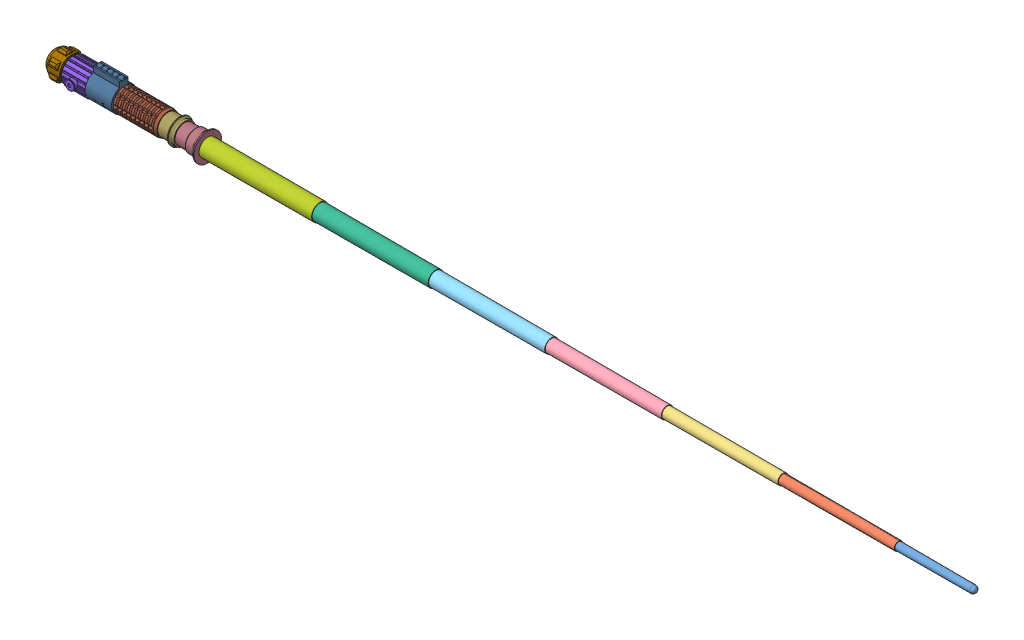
SolidWorks assembly Luke Skywalker's Return of the Jedi Lightsaber.SLDASM, configuration Default (file format 8000). Lengths in mm.
Overall size (1684.61 94.96 54.4).
15 component instances, 15 part files, 31 mates.
Components (placement in the parent):
- Blade 1-1: Blade 1.sldprt [Default] at (1477.9625 0 0) x (1 0 0) z (0 -0.971168 0.238396) size (172.36 13.85 13.85)
- Blade 2-1: Blade 2.sldprt [Default] at (1266.825 0 0) x (1 0 0) z (0 -0.978512 0.206192) size (241.3 16.88 16.88)
- Blade 3-1: Blade 3.sldprt [Default] at (1055.6875 0 0) x (1 0 0) z (0 0.380326 -0.924853) size (241.3 19.91 19.91)
- Blade 4-1: Blade 4.sldprt [Default] at (844.55 0 0) x (1 0 0) z (0 0.994163 -0.107886) size (241.3 22.93 22.93)
- Blade 5-1: Blade 5.sldprt [Default] at (633.4125 0 0) x (1 0 0) z (0 0.970787 0.239945) size (241.3 25.96 25.96)
- Blade 6-1: Blade 6.sldprt [Default] at (422.275 0 0) x (1 0 0) z (0 0.858988 0.511995) size (241.3 28.98 28.98)
- Blade 7-1: Blade 7.sldprt [Default] at (211.1375 0 0) x (1 0 0) z (0 0.854899 0.518794) size (241.3 32.01 32.01)
- Blade 8-1: Blade 8.sldprt [Default] at (227.33 0 0) x (1 0 0) z (0 -0.589235 -0.807962) (suppressed, hidden)
- Blade 9-1: Blade 9.sldprt [Default] at (211.1375 0 0) x (1 0 0) z (0 0.873222 -0.487322) (suppressed, hidden)
- Bottom Grips-5: Bottom Grips.sldprt [Default] at origin size (44.49 47.2 52.39)
- Bottom-2: Bottom.sldprt [Default] at origin size (36.2 50.97 46.82)
- Activator-3: Activator.sldprt [Default] at origin size (48.13 56.94 48.05)
- Top Grips-3: Top Grips.sldprt [Default] at origin size (80.68 42.84 42.84)
- Top 1-3: Top 1.sldprt [Default] at origin size (30.38 45.29 45.29)
- Top 2-3: Top 2.sldprt [Default] at origin size (42.1 50.46 50.46)
Mates (geometry in assembly coordinates):
- Blade Travel Hilt to Nine: limit distance = 211.1375 mm anti-aligned: plane of Blade 9-1 through (249.2375 16.1273 6.9539) normal (-1 0 0); plane of ? through (38.1 0 0) normal (1 0 0)
- Blade Travel Eight to Nine: limit distance = 211.1375 mm aligned: plane of Blade 9-1 through (244.6655 -8.5587 -15.3361) normal (-1 0 0); plane of Blade 8-1 through (455.803 -13.109 9.5602) normal (-1 0 0)
- Blade Travel Seven to Eight: limit distance = 211.1375 mm aligned: plane of Blade 8-1 through (246.38 -14.1432 10.3145) normal (-1 0 0); plane of Blade 7-1 through (424.18 8.3036 -13.6832) normal (-1 0 0)
- Blade Travel Six to Seven: limit distance = 211.1375 mm aligned: plane of Blade 7-1 through (245.4275 8.3036 -13.6832) normal (-1 0 0); plane of Blade 6-1 through (456.565 7.42 -12.4488) normal (-1 0 0)
- Blade Travel Five to Six: limit distance = 211.1375 mm aligned: plane of Blade 6-1 through (456.565 7.42 -12.4488) normal (-1 0 0); plane of Blade 5-1 through (667.7025 3.1143 -12.6001) normal (-1 0 0)
- Blade Travel Four to Five: limit distance = 211.1375 mm aligned: plane of Blade 5-1 through (667.7025 3.1143 -12.6001) normal (-1 0 0); plane of Blade 4-1 through (878.84 -1.237 -11.3991) normal (-1 0 0)
- Blade Travel Three to Four: limit distance = 211.1375 mm aligned: plane of Blade 4-1 through (878.84 -1.237 -11.3991) normal (-1 0 0); plane of Blade 3-1 through (1089.9775 -9.2049 -3.7853) normal (-1 0 0)
- Blade Travel Two to Three: limit distance = 211.1375 mm aligned: plane of Blade 3-1 through (1089.9775 -9.2049 -3.7853) normal (-1 0 0); plane of Blade 2-1 through (1301.115 1.7402 8.2583) normal (-1 0 0)
- Blade Travel One to Two: limit distance = 211.1375 mm aligned: plane of Blade 2-1 through (1301.115 1.7402 8.2583) normal (-1 0 0); plane of Blade 1-1 through (1512.2525 1.6512 6.7268) normal (-1 0 0)
- Concentric1: concentric aligned: circle of Blade 1-1; circle of Blade 2-1
- Concentric2: concentric aligned: circle of Blade 2-1; circle of Blade 3-1
- Concentric3: concentric aligned: circle of Blade 3-1; circle of Blade 4-1
- Concentric4: concentric aligned: circle of Blade 4-1; circle of Blade 5-1
- Concentric5: concentric aligned: circle of Blade 5-1; circle of Blade 6-1
- Concentric6: concentric aligned: circle of Blade 6-1; circle of Blade 7-1
- Concentric7: concentric aligned: circle of Blade 7-1; circle of Blade 8-1
- Concentric8: concentric aligned: circle of Blade 8-1; circle of Blade 9-1
- Coincident2: coincident aligned: axis of Blade 1-1 through (1512.2525 0 0) axis (1 0 0); line of assembly
- Min Distance Blade 9: limit distance = 133.35 mm anti-aligned: plane of Blade 9-1 through (244.6655 -8.5587 -15.3361) normal (-1 0 0); line of assembly
- Min Distance Blade 8: limit distance = 133.35 mm anti-aligned: plane of Blade 8-1 through (246.38 -14.1432 10.3145) normal (-1 0 0); line of assembly
- Min Distance Blade 7: limit distance = 211.1375 mm anti-aligned: plane of Blade 7-1 through (245.4275 8.3036 -13.6832) normal (-1 0 0); line of assembly
- Min Distance Blade 6: limit distance = 133.35 mm anti-aligned: plane of ? through (152.4 7.42 -12.4488) normal (-1 0 0)
- Min Distance Blade 5: limit distance = 133.35 mm anti-aligned: plane of ? through (191.135 2.93 -11.8544) normal (-1 0 0)
- Min Distance Blade 4: limit distance = 133.35 mm anti-aligned: plane of ? through (217.4875 -1.4293 -13.1707) normal (-1 0 0)
- Min Distance Blade 3: limit distance = 133.35 mm anti-aligned: plane of ? through (191.135 -8.8188 -3.6266) normal (-1 0 0)
- Min Distance Blade 2: limit distance = 133.35 mm anti-aligned: plane of ? through (191.135 1.6903 8.0214) normal (-1 0 0)
- Concentric16: concentric anti-aligned: circle of ?; circle of ?
- Concentric17: concentric aligned: circle of ?; circle of ?
- Concentric18: concentric aligned: circle of ?; circle of ?
- Concentric19: concentric aligned: circle of ?; circle of ?
- Concentric20: concentric aligned: circle of ?; circle of ?
